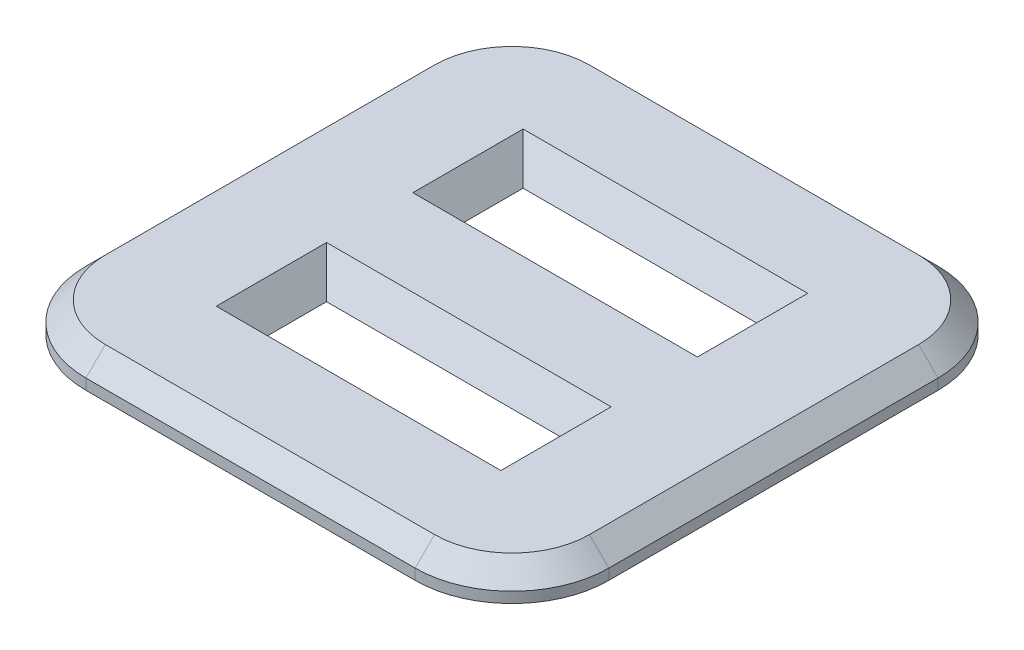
ISO-10303-21;
HEADER;
FILE_DESCRIPTION(('STEP AP214'),'2;1');
FILE_NAME('part.step','',(''),(''),'','','');
FILE_SCHEMA(('AUTOMOTIVE_DESIGN { 1 0 10303 214 1 1 1 1 }'));
ENDSEC;
DATA;
#1=APPLICATION_CONTEXT('core data for automotive mechanical design processes');
#2=APPLICATION_PROTOCOL_DEFINITION('international standard','automotive_design',2000,#1);
#3=PRODUCT_CONTEXT('',#1,'mechanical');
#4=PRODUCT('Part','Part','',(#3));
#5=PRODUCT_RELATED_PRODUCT_CATEGORY('part','',(#4));
#6=PRODUCT_DEFINITION_FORMATION('','',#4);
#7=PRODUCT_DEFINITION_CONTEXT('part definition',#1,'design');
#8=PRODUCT_DEFINITION('design','',#6,#7);
#9=PRODUCT_DEFINITION_SHAPE('','',#8);
#10=(LENGTH_UNIT() NAMED_UNIT(*) SI_UNIT(.MILLI.,.METRE.));
#11=(NAMED_UNIT(*) PLANE_ANGLE_UNIT() SI_UNIT($,.RADIAN.));
#12=(NAMED_UNIT(*) SI_UNIT($,.STERADIAN.) SOLID_ANGLE_UNIT());
#13=UNCERTAINTY_MEASURE_WITH_UNIT(LENGTH_MEASURE(1.E-05),#10,'distance_accuracy_value','');
#14=(GEOMETRIC_REPRESENTATION_CONTEXT(3) GLOBAL_UNCERTAINTY_ASSIGNED_CONTEXT((#13)) GLOBAL_UNIT_ASSIGNED_CONTEXT((#10,
#11,#12)) REPRESENTATION_CONTEXT('',''));
#15=CARTESIAN_POINT('',(0.,0.,0.));
#16=DIRECTION('',(0.,0.,1.));
#17=DIRECTION('',(1.,0.,0.));
#18=AXIS2_PLACEMENT_3D('',#15,#16,#17);
#19=CARTESIAN_POINT('',(-2.7,0.31,-2.7));
#20=DIRECTION('',(1.,0.,0.));
#21=DIRECTION('',(0.,0.,-1.));
#22=AXIS2_PLACEMENT_3D('',#19,#20,#21);
#23=PLANE('',#22);
#24=DIRECTION('',(0.,-1.,0.));
#25=VECTOR('',#24,1.);
#26=CARTESIAN_POINT('',(-2.7,0.31,1.7));
#27=LINE('',#26,#25);
#28=CARTESIAN_POINT('',(-2.7,0.,1.7));
#29=VERTEX_POINT('',#28);
#30=CARTESIAN_POINT('',(-2.7,0.11,1.7));
#31=VERTEX_POINT('',#30);
#32=EDGE_CURVE('E235',#29,#31,#27,.F.);
#33=ORIENTED_EDGE('',*,*,#32,.T.);
#34=DIRECTION('',(0.,0.,-1.));
#35=VECTOR('',#34,1.);
#36=CARTESIAN_POINT('',(-2.7,0.11,-2.7));
#37=LINE('',#36,#35);
#38=CARTESIAN_POINT('',(-2.7,0.11,-1.7));
#39=VERTEX_POINT('',#38);
#40=EDGE_CURVE('E287',#31,#39,#37,.T.);
#41=ORIENTED_EDGE('',*,*,#40,.T.);
#42=DIRECTION('',(0.,-1.,0.));
#43=VECTOR('',#42,1.);
#44=CARTESIAN_POINT('',(-2.7,0.31,-1.7));
#45=LINE('',#44,#43);
#46=CARTESIAN_POINT('',(-2.7,0.,-1.7));
#47=VERTEX_POINT('',#46);
#48=EDGE_CURVE('E238',#39,#47,#45,.T.);
#49=ORIENTED_EDGE('',*,*,#48,.T.);
#50=DIRECTION('',(0.,0.,1.));
#51=VECTOR('',#50,1.);
#52=CARTESIAN_POINT('',(-2.7,0.,-2.7));
#53=LINE('',#52,#51);
#54=EDGE_CURVE('E222',#47,#29,#53,.T.);
#55=ORIENTED_EDGE('',*,*,#54,.T.);
#56=EDGE_LOOP('',(#33,#41,#49,#55));
#57=FACE_BOUND('',#56,.T.);
#58=ADVANCED_FACE('F43',(#57),#23,.F.);
#59=CARTESIAN_POINT('',(2.7,0.31,2.7));
#60=DIRECTION('',(0.,0.,-1.));
#61=DIRECTION('',(-1.,0.,0.));
#62=AXIS2_PLACEMENT_3D('',#59,#60,#61);
#63=PLANE('',#62);
#64=DIRECTION('',(0.,-1.,0.));
#65=VECTOR('',#64,1.);
#66=CARTESIAN_POINT('',(1.7,0.31,2.7));
#67=LINE('',#66,#65);
#68=CARTESIAN_POINT('',(1.7,0.,2.7));
#69=VERTEX_POINT('',#68);
#70=CARTESIAN_POINT('',(1.7,0.11,2.7));
#71=VERTEX_POINT('',#70);
#72=EDGE_CURVE('E260',#69,#71,#67,.F.);
#73=ORIENTED_EDGE('',*,*,#72,.T.);
#74=DIRECTION('',(-1.,0.,0.));
#75=VECTOR('',#74,1.);
#76=CARTESIAN_POINT('',(2.7,0.11,2.7));
#77=LINE('',#76,#75);
#78=CARTESIAN_POINT('',(-1.7,0.11,2.7));
#79=VERTEX_POINT('',#78);
#80=EDGE_CURVE('E283',#71,#79,#77,.T.);
#81=ORIENTED_EDGE('',*,*,#80,.T.);
#82=DIRECTION('',(0.,-1.,0.));
#83=VECTOR('',#82,1.);
#84=CARTESIAN_POINT('',(-1.7,0.31,2.7));
#85=LINE('',#84,#83);
#86=CARTESIAN_POINT('',(-1.7,0.,2.7));
#87=VERTEX_POINT('',#86);
#88=EDGE_CURVE('E258',#79,#87,#85,.T.);
#89=ORIENTED_EDGE('',*,*,#88,.T.);
#90=DIRECTION('',(1.,0.,0.));
#91=VECTOR('',#90,1.);
#92=CARTESIAN_POINT('',(2.7,0.,2.7));
#93=LINE('',#92,#91);
#94=EDGE_CURVE('E225',#87,#69,#93,.T.);
#95=ORIENTED_EDGE('',*,*,#94,.T.);
#96=EDGE_LOOP('',(#73,#81,#89,#95));
#97=FACE_BOUND('',#96,.T.);
#98=ADVANCED_FACE('F356',(#97),#63,.F.);
#99=CARTESIAN_POINT('',(2.7,0.31,-2.7));
#100=DIRECTION('',(-1.,0.,0.));
#101=DIRECTION('',(0.,0.,1.));
#102=AXIS2_PLACEMENT_3D('',#99,#100,#101);
#103=PLANE('',#102);
#104=DIRECTION('',(0.,-1.,0.));
#105=VECTOR('',#104,1.);
#106=CARTESIAN_POINT('',(2.7,0.31,-1.7));
#107=LINE('',#106,#105);
#108=CARTESIAN_POINT('',(2.7,0.,-1.7));
#109=VERTEX_POINT('',#108);
#110=CARTESIAN_POINT('',(2.7,0.11,-1.7));
#111=VERTEX_POINT('',#110);
#112=EDGE_CURVE('E255',#109,#111,#107,.F.);
#113=ORIENTED_EDGE('',*,*,#112,.T.);
#114=DIRECTION('',(0.,0.,1.));
#115=VECTOR('',#114,1.);
#116=CARTESIAN_POINT('',(2.7,0.11,-2.7));
#117=LINE('',#116,#115);
#118=CARTESIAN_POINT('',(2.7,0.11,1.7));
#119=VERTEX_POINT('',#118);
#120=EDGE_CURVE('E295',#111,#119,#117,.T.);
#121=ORIENTED_EDGE('',*,*,#120,.T.);
#122=DIRECTION('',(0.,-1.,0.));
#123=VECTOR('',#122,1.);
#124=CARTESIAN_POINT('',(2.7,0.31,1.7));
#125=LINE('',#124,#123);
#126=CARTESIAN_POINT('',(2.7,0.,1.7));
#127=VERTEX_POINT('',#126);
#128=EDGE_CURVE('E253',#119,#127,#125,.T.);
#129=ORIENTED_EDGE('',*,*,#128,.T.);
#130=DIRECTION('',(0.,0.,-1.));
#131=VECTOR('',#130,1.);
#132=CARTESIAN_POINT('',(2.7,0.,-2.7));
#133=LINE('',#132,#131);
#134=EDGE_CURVE('E229',#127,#109,#133,.T.);
#135=ORIENTED_EDGE('',*,*,#134,.T.);
#136=EDGE_LOOP('',(#113,#121,#129,#135));
#137=FACE_BOUND('',#136,.T.);
#138=ADVANCED_FACE('F362',(#137),#103,.F.);
#139=CARTESIAN_POINT('',(2.7,0.31,-2.7));
#140=DIRECTION('',(0.,0.,1.));
#141=DIRECTION('',(1.,0.,0.));
#142=AXIS2_PLACEMENT_3D('',#139,#140,#141);
#143=PLANE('',#142);
#144=DIRECTION('',(0.,-1.,0.));
#145=VECTOR('',#144,1.);
#146=CARTESIAN_POINT('',(-1.7,0.31,-2.7));
#147=LINE('',#146,#145);
#148=CARTESIAN_POINT('',(-1.7,0.,-2.7));
#149=VERTEX_POINT('',#148);
#150=CARTESIAN_POINT('',(-1.7,0.11,-2.7));
#151=VERTEX_POINT('',#150);
#152=EDGE_CURVE('E250',#149,#151,#147,.F.);
#153=ORIENTED_EDGE('',*,*,#152,.T.);
#154=DIRECTION('',(1.,0.,0.));
#155=VECTOR('',#154,1.);
#156=CARTESIAN_POINT('',(2.7,0.11,-2.7));
#157=LINE('',#156,#155);
#158=CARTESIAN_POINT('',(1.7,0.11,-2.7));
#159=VERTEX_POINT('',#158);
#160=EDGE_CURVE('E291',#151,#159,#157,.T.);
#161=ORIENTED_EDGE('',*,*,#160,.T.);
#162=DIRECTION('',(0.,-1.,0.));
#163=VECTOR('',#162,1.);
#164=CARTESIAN_POINT('',(1.7,0.31,-2.7));
#165=LINE('',#164,#163);
#166=CARTESIAN_POINT('',(1.7,0.,-2.7));
#167=VERTEX_POINT('',#166);
#168=EDGE_CURVE('E248',#159,#167,#165,.T.);
#169=ORIENTED_EDGE('',*,*,#168,.T.);
#170=DIRECTION('',(-1.,0.,0.));
#171=VECTOR('',#170,1.);
#172=CARTESIAN_POINT('',(2.7,0.,-2.7));
#173=LINE('',#172,#171);
#174=EDGE_CURVE('E232',#167,#149,#173,.T.);
#175=ORIENTED_EDGE('',*,*,#174,.T.);
#176=EDGE_LOOP('',(#153,#161,#169,#175));
#177=FACE_BOUND('',#176,.T.);
#178=ADVANCED_FACE('F518',(#177),#143,.F.);
#179=CARTESIAN_POINT('',(0.,0.31,0.));
#180=DIRECTION('',(0.,-1.,0.));
#181=DIRECTION('',(0.,0.,-1.));
#182=AXIS2_PLACEMENT_3D('',#179,#180,#181);
#183=PLANE('',#182);
#184=DIRECTION('',(-1.,0.,0.));
#185=VECTOR('',#184,1.);
#186=CARTESIAN_POINT('',(0.,0.31,1.58449223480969));
#187=LINE('',#186,#185);
#188=CARTESIAN_POINT('',(1.46949223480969,0.31,1.58449223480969));
#189=VERTEX_POINT('',#188);
#190=CARTESIAN_POINT('',(-1.46949223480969,0.31,1.58449223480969));
#191=VERTEX_POINT('',#190);
#192=EDGE_CURVE('E53',#189,#191,#187,.T.);
#193=ORIENTED_EDGE('',*,*,#192,.T.);
#194=DIRECTION('',(0.,0.,-1.));
#195=VECTOR('',#194,1.);
#196=CARTESIAN_POINT('',(-1.46949223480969,0.31,0.));
#197=LINE('',#196,#195);
#198=CARTESIAN_POINT('',(-1.46949223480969,0.31,0.445507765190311));
#199=VERTEX_POINT('',#198);
#200=EDGE_CURVE('E11',#191,#199,#197,.T.);
#201=ORIENTED_EDGE('',*,*,#200,.T.);
#202=DIRECTION('',(1.,0.,0.));
#203=VECTOR('',#202,1.);
#204=CARTESIAN_POINT('',(0.,0.31,0.445507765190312));
#205=LINE('',#204,#203);
#206=CARTESIAN_POINT('',(1.46949223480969,0.31,0.445507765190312));
#207=VERTEX_POINT('',#206);
#208=EDGE_CURVE('E324',#199,#207,#205,.T.);
#209=ORIENTED_EDGE('',*,*,#208,.T.);
#210=DIRECTION('',(0.,0.,1.));
#211=VECTOR('',#210,1.);
#212=CARTESIAN_POINT('',(1.46949223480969,0.31,0.));
#213=LINE('',#212,#211);
#214=EDGE_CURVE('E64',#207,#189,#213,.T.);
#215=ORIENTED_EDGE('',*,*,#214,.T.);
#216=EDGE_LOOP('',(#193,#201,#209,#215));
#217=FACE_BOUND('',#216,.T.);
#218=DIRECTION('',(0.,0.,1.));
#219=VECTOR('',#218,1.);
#220=CARTESIAN_POINT('',(1.46949223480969,0.31,0.));
#221=LINE('',#220,#219);
#222=CARTESIAN_POINT('',(1.46949223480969,0.31,-1.58449223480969));
#223=VERTEX_POINT('',#222);
#224=CARTESIAN_POINT('',(1.46949223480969,0.31,-0.445507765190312));
#225=VERTEX_POINT('',#224);
#226=EDGE_CURVE('E320',#223,#225,#221,.T.);
#227=ORIENTED_EDGE('',*,*,#226,.T.);
#228=DIRECTION('',(-1.,0.,0.));
#229=VECTOR('',#228,1.);
#230=CARTESIAN_POINT('',(0.,0.31,-0.445507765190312));
#231=LINE('',#230,#229);
#232=CARTESIAN_POINT('',(-1.46949223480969,0.31,-0.445507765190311));
#233=VERTEX_POINT('',#232);
#234=EDGE_CURVE('E322',#225,#233,#231,.T.);
#235=ORIENTED_EDGE('',*,*,#234,.T.);
#236=DIRECTION('',(0.,0.,-1.));
#237=VECTOR('',#236,1.);
#238=CARTESIAN_POINT('',(-1.46949223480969,0.31,0.));
#239=LINE('',#238,#237);
#240=CARTESIAN_POINT('',(-1.46949223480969,0.31,-1.58449223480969));
#241=VERTEX_POINT('',#240);
#242=EDGE_CURVE('E197',#233,#241,#239,.T.);
#243=ORIENTED_EDGE('',*,*,#242,.T.);
#244=DIRECTION('',(1.,0.,0.));
#245=VECTOR('',#244,1.);
#246=CARTESIAN_POINT('',(0.,0.31,-1.58449223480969));
#247=LINE('',#246,#245);
#248=EDGE_CURVE('E297',#241,#223,#247,.T.);
#249=ORIENTED_EDGE('',*,*,#248,.T.);
#250=EDGE_LOOP('',(#227,#235,#243,#249));
#251=FACE_BOUND('',#250,.T.);
#252=DIRECTION('',(1.,0.,0.));
#253=VECTOR('',#252,1.);
#254=CARTESIAN_POINT('',(0.,0.31,2.5));
#255=LINE('',#254,#253);
#256=CARTESIAN_POINT('',(-1.7,0.31,2.5));
#257=VERTEX_POINT('',#256);
#258=CARTESIAN_POINT('',(1.7,0.31,2.5));
#259=VERTEX_POINT('',#258);
#260=EDGE_CURVE('E275',#257,#259,#255,.T.);
#261=ORIENTED_EDGE('',*,*,#260,.T.);
#262=CARTESIAN_POINT('',(1.7,0.31,1.7));
#263=DIRECTION('',(0.,-1.,0.));
#264=DIRECTION('',(0.,0.,-1.));
#265=AXIS2_PLACEMENT_3D('',#262,#263,#264);
#266=CIRCLE('',#265,0.800000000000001);
#267=CARTESIAN_POINT('',(2.5,0.31,1.7));
#268=VERTEX_POINT('',#267);
#269=EDGE_CURVE('E277',#259,#268,#266,.F.);
#270=ORIENTED_EDGE('',*,*,#269,.T.);
#271=DIRECTION('',(0.,0.,-1.));
#272=VECTOR('',#271,1.);
#273=CARTESIAN_POINT('',(2.5,0.31,0.));
#274=LINE('',#273,#272);
#275=CARTESIAN_POINT('',(2.5,0.31,-1.7));
#276=VERTEX_POINT('',#275);
#277=EDGE_CURVE('E263',#268,#276,#274,.T.);
#278=ORIENTED_EDGE('',*,*,#277,.T.);
#279=CARTESIAN_POINT('',(1.7,0.31,-1.7));
#280=DIRECTION('',(0.,-1.,0.));
#281=DIRECTION('',(0.,0.,-1.));
#282=AXIS2_PLACEMENT_3D('',#279,#280,#281);
#283=CIRCLE('',#282,0.800000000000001);
#284=CARTESIAN_POINT('',(1.7,0.31,-2.5));
#285=VERTEX_POINT('',#284);
#286=EDGE_CURVE('E265',#276,#285,#283,.F.);
#287=ORIENTED_EDGE('',*,*,#286,.T.);
#288=DIRECTION('',(-1.,0.,0.));
#289=VECTOR('',#288,1.);
#290=CARTESIAN_POINT('',(0.,0.31,-2.5));
#291=LINE('',#290,#289);
#292=CARTESIAN_POINT('',(-1.7,0.31,-2.5));
#293=VERTEX_POINT('',#292);
#294=EDGE_CURVE('E267',#285,#293,#291,.T.);
#295=ORIENTED_EDGE('',*,*,#294,.T.);
#296=CARTESIAN_POINT('',(-1.7,0.31,-1.7));
#297=DIRECTION('',(0.,-1.,0.));
#298=DIRECTION('',(0.,0.,-1.));
#299=AXIS2_PLACEMENT_3D('',#296,#297,#298);
#300=CIRCLE('',#299,0.800000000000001);
#301=CARTESIAN_POINT('',(-2.5,0.31,-1.7));
#302=VERTEX_POINT('',#301);
#303=EDGE_CURVE('E269',#293,#302,#300,.F.);
#304=ORIENTED_EDGE('',*,*,#303,.T.);
#305=DIRECTION('',(0.,0.,1.));
#306=VECTOR('',#305,1.);
#307=CARTESIAN_POINT('',(-2.5,0.31,0.));
#308=LINE('',#307,#306);
#309=CARTESIAN_POINT('',(-2.5,0.31,1.7));
#310=VERTEX_POINT('',#309);
#311=EDGE_CURVE('E271',#302,#310,#308,.T.);
#312=ORIENTED_EDGE('',*,*,#311,.T.);
#313=CARTESIAN_POINT('',(-1.7,0.31,1.7));
#314=DIRECTION('',(0.,-1.,0.));
#315=DIRECTION('',(0.,0.,-1.));
#316=AXIS2_PLACEMENT_3D('',#313,#314,#315);
#317=CIRCLE('',#316,0.800000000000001);
#318=EDGE_CURVE('E273',#310,#257,#317,.F.);
#319=ORIENTED_EDGE('',*,*,#318,.T.);
#320=EDGE_LOOP('',(#261,#270,#278,#287,#295,#304,#312,#319));
#321=FACE_BOUND('',#320,.T.);
#322=ADVANCED_FACE('F344',(#217,#251,#321),#183,.F.);
#323=CARTESIAN_POINT('',(0.,0.,0.));
#324=DIRECTION('',(0.,-1.,0.));
#325=DIRECTION('',(0.,0.,-1.));
#326=AXIS2_PLACEMENT_3D('',#323,#324,#325);
#327=PLANE('',#326);
#328=DIRECTION('',(0.,0.,1.));
#329=VECTOR('',#328,1.);
#330=CARTESIAN_POINT('',(-1.25,0.,-1.365));
#331=LINE('',#330,#329);
#332=CARTESIAN_POINT('',(-1.25,0.,-1.365));
#333=VERTEX_POINT('',#332);
#334=CARTESIAN_POINT('',(-1.25,0.,-0.664999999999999));
#335=VERTEX_POINT('',#334);
#336=EDGE_CURVE('E181',#333,#335,#331,.T.);
#337=ORIENTED_EDGE('',*,*,#336,.T.);
#338=DIRECTION('',(1.,0.,0.));
#339=VECTOR('',#338,1.);
#340=CARTESIAN_POINT('',(1.25,0.,-0.664999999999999));
#341=LINE('',#340,#339);
#342=CARTESIAN_POINT('',(1.25,0.,-0.664999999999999));
#343=VERTEX_POINT('',#342);
#344=EDGE_CURVE('E186',#335,#343,#341,.T.);
#345=ORIENTED_EDGE('',*,*,#344,.T.);
#346=DIRECTION('',(0.,0.,-1.));
#347=VECTOR('',#346,1.);
#348=CARTESIAN_POINT('',(1.25,0.,-1.365));
#349=LINE('',#348,#347);
#350=CARTESIAN_POINT('',(1.25,0.,-1.365));
#351=VERTEX_POINT('',#350);
#352=EDGE_CURVE('E207',#343,#351,#349,.T.);
#353=ORIENTED_EDGE('',*,*,#352,.T.);
#354=DIRECTION('',(-1.,0.,0.));
#355=VECTOR('',#354,1.);
#356=CARTESIAN_POINT('',(1.25,0.,-1.365));
#357=LINE('',#356,#355);
#358=EDGE_CURVE('E188',#351,#333,#357,.T.);
#359=ORIENTED_EDGE('',*,*,#358,.T.);
#360=EDGE_LOOP('',(#337,#345,#353,#359));
#361=FACE_BOUND('',#360,.T.);
#362=DIRECTION('',(0.,0.,-1.));
#363=VECTOR('',#362,1.);
#364=CARTESIAN_POINT('',(1.25,0.,1.365));
#365=LINE('',#364,#363);
#366=CARTESIAN_POINT('',(1.25,0.,1.365));
#367=VERTEX_POINT('',#366);
#368=CARTESIAN_POINT('',(1.25,0.,0.664999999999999));
#369=VERTEX_POINT('',#368);
#370=EDGE_CURVE('E192',#367,#369,#365,.T.);
#371=ORIENTED_EDGE('',*,*,#370,.T.);
#372=DIRECTION('',(-1.,0.,0.));
#373=VECTOR('',#372,1.);
#374=CARTESIAN_POINT('',(1.25,0.,0.664999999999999));
#375=LINE('',#374,#373);
#376=CARTESIAN_POINT('',(-1.25,0.,0.664999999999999));
#377=VERTEX_POINT('',#376);
#378=EDGE_CURVE('E219',#369,#377,#375,.T.);
#379=ORIENTED_EDGE('',*,*,#378,.T.);
#380=DIRECTION('',(0.,0.,1.));
#381=VECTOR('',#380,1.);
#382=CARTESIAN_POINT('',(-1.25,0.,1.365));
#383=LINE('',#382,#381);
#384=CARTESIAN_POINT('',(-1.25,0.,1.365));
#385=VERTEX_POINT('',#384);
#386=EDGE_CURVE('E215',#377,#385,#383,.T.);
#387=ORIENTED_EDGE('',*,*,#386,.T.);
#388=DIRECTION('',(1.,0.,0.));
#389=VECTOR('',#388,1.);
#390=CARTESIAN_POINT('',(1.25,0.,1.365));
#391=LINE('',#390,#389);
#392=EDGE_CURVE('E213',#385,#367,#391,.T.);
#393=ORIENTED_EDGE('',*,*,#392,.T.);
#394=EDGE_LOOP('',(#371,#379,#387,#393));
#395=FACE_BOUND('',#394,.T.);
#396=ORIENTED_EDGE('',*,*,#54,.F.);
#397=CARTESIAN_POINT('',(-1.7,0.,-1.7));
#398=DIRECTION('',(0.,-1.,0.));
#399=DIRECTION('',(0.,0.,-1.));
#400=AXIS2_PLACEMENT_3D('',#397,#398,#399);
#401=CIRCLE('',#400,1.);
#402=EDGE_CURVE('E246',#47,#149,#401,.T.);
#403=ORIENTED_EDGE('',*,*,#402,.T.);
#404=ORIENTED_EDGE('',*,*,#174,.F.);
#405=CARTESIAN_POINT('',(1.7,0.,-1.7));
#406=DIRECTION('',(0.,-1.,0.));
#407=DIRECTION('',(0.,0.,-1.));
#408=AXIS2_PLACEMENT_3D('',#405,#406,#407);
#409=CIRCLE('',#408,1.);
#410=EDGE_CURVE('E244',#167,#109,#409,.T.);
#411=ORIENTED_EDGE('',*,*,#410,.T.);
#412=ORIENTED_EDGE('',*,*,#134,.F.);
#413=CARTESIAN_POINT('',(1.7,0.,1.7));
#414=DIRECTION('',(0.,-1.,0.));
#415=DIRECTION('',(0.,0.,-1.));
#416=AXIS2_PLACEMENT_3D('',#413,#414,#415);
#417=CIRCLE('',#416,1.);
#418=EDGE_CURVE('E242',#127,#69,#417,.T.);
#419=ORIENTED_EDGE('',*,*,#418,.T.);
#420=ORIENTED_EDGE('',*,*,#94,.F.);
#421=CARTESIAN_POINT('',(-1.7,0.,1.7));
#422=DIRECTION('',(0.,-1.,0.));
#423=DIRECTION('',(0.,0.,-1.));
#424=AXIS2_PLACEMENT_3D('',#421,#422,#423);
#425=CIRCLE('',#424,1.);
#426=EDGE_CURVE('E240',#87,#29,#425,.T.);
#427=ORIENTED_EDGE('',*,*,#426,.T.);
#428=EDGE_LOOP('',(#396,#403,#404,#411,#412,#419,#420,#427));
#429=FACE_BOUND('',#428,.T.);
#430=ADVANCED_FACE('F183',(#361,#395,#429),#327,.T.);
#431=CARTESIAN_POINT('',(-1.7,0.31,-1.7));
#432=DIRECTION('',(0.,-1.,0.));
#433=DIRECTION('',(0.,0.,-1.));
#434=AXIS2_PLACEMENT_3D('',#431,#432,#433);
#435=CYLINDRICAL_SURFACE('',#434,1.);
#436=ORIENTED_EDGE('',*,*,#48,.F.);
#437=CARTESIAN_POINT('',(-1.7,0.11,-1.7));
#438=DIRECTION('',(0.,-1.,0.));
#439=DIRECTION('',(0.,0.,-1.));
#440=AXIS2_PLACEMENT_3D('',#437,#438,#439);
#441=CIRCLE('',#440,1.);
#442=EDGE_CURVE('E289',#39,#151,#441,.T.);
#443=ORIENTED_EDGE('',*,*,#442,.T.);
#444=ORIENTED_EDGE('',*,*,#152,.F.);
#445=ORIENTED_EDGE('',*,*,#402,.F.);
#446=EDGE_LOOP('',(#436,#443,#444,#445));
#447=FACE_BOUND('',#446,.T.);
#448=ADVANCED_FACE('F367',(#447),#435,.T.);
#449=CARTESIAN_POINT('',(1.7,0.31,-1.7));
#450=DIRECTION('',(0.,-1.,0.));
#451=DIRECTION('',(0.,0.,-1.));
#452=AXIS2_PLACEMENT_3D('',#449,#450,#451);
#453=CYLINDRICAL_SURFACE('',#452,1.);
#454=ORIENTED_EDGE('',*,*,#168,.F.);
#455=CARTESIAN_POINT('',(1.7,0.11,-1.7));
#456=DIRECTION('',(0.,-1.,0.));
#457=DIRECTION('',(0.,0.,-1.));
#458=AXIS2_PLACEMENT_3D('',#455,#456,#457);
#459=CIRCLE('',#458,1.);
#460=EDGE_CURVE('E293',#159,#111,#459,.T.);
#461=ORIENTED_EDGE('',*,*,#460,.T.);
#462=ORIENTED_EDGE('',*,*,#112,.F.);
#463=ORIENTED_EDGE('',*,*,#410,.F.);
#464=EDGE_LOOP('',(#454,#461,#462,#463));
#465=FACE_BOUND('',#464,.T.);
#466=ADVANCED_FACE('F370',(#465),#453,.T.);
#467=CARTESIAN_POINT('',(1.7,0.31,1.7));
#468=DIRECTION('',(0.,-1.,0.));
#469=DIRECTION('',(0.,0.,-1.));
#470=AXIS2_PLACEMENT_3D('',#467,#468,#469);
#471=CYLINDRICAL_SURFACE('',#470,1.);
#472=ORIENTED_EDGE('',*,*,#128,.F.);
#473=CARTESIAN_POINT('',(1.7,0.11,1.7));
#474=DIRECTION('',(0.,-1.,0.));
#475=DIRECTION('',(0.,0.,-1.));
#476=AXIS2_PLACEMENT_3D('',#473,#474,#475);
#477=CIRCLE('',#476,1.);
#478=EDGE_CURVE('E280',#119,#71,#477,.T.);
#479=ORIENTED_EDGE('',*,*,#478,.T.);
#480=ORIENTED_EDGE('',*,*,#72,.F.);
#481=ORIENTED_EDGE('',*,*,#418,.F.);
#482=EDGE_LOOP('',(#472,#479,#480,#481));
#483=FACE_BOUND('',#482,.T.);
#484=ADVANCED_FACE('F374',(#483),#471,.T.);
#485=CARTESIAN_POINT('',(-1.7,0.31,1.7));
#486=DIRECTION('',(0.,-1.,0.));
#487=DIRECTION('',(0.,0.,-1.));
#488=AXIS2_PLACEMENT_3D('',#485,#486,#487);
#489=CYLINDRICAL_SURFACE('',#488,1.);
#490=ORIENTED_EDGE('',*,*,#88,.F.);
#491=CARTESIAN_POINT('',(-1.7,0.11,1.7));
#492=DIRECTION('',(0.,-1.,0.));
#493=DIRECTION('',(0.,0.,-1.));
#494=AXIS2_PLACEMENT_3D('',#491,#492,#493);
#495=CIRCLE('',#494,1.);
#496=EDGE_CURVE('E285',#79,#31,#495,.T.);
#497=ORIENTED_EDGE('',*,*,#496,.T.);
#498=ORIENTED_EDGE('',*,*,#32,.F.);
#499=ORIENTED_EDGE('',*,*,#426,.F.);
#500=EDGE_LOOP('',(#490,#497,#498,#499));
#501=FACE_BOUND('',#500,.T.);
#502=ADVANCED_FACE('F378',(#501),#489,.T.);
#503=CARTESIAN_POINT('',(-1.7,0.31,-1.7));
#504=DIRECTION('',(0.,-1.,0.));
#505=DIRECTION('',(0.,0.,-1.));
#506=AXIS2_PLACEMENT_3D('',#503,#504,#505);
#507=CONICAL_SURFACE('',#506,0.800000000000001,0.785398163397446);
#508=DIRECTION('',(0.,0.707106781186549,0.707106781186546));
#509=VECTOR('',#508,1.);
#510=CARTESIAN_POINT('',(-1.7,0.11,-2.7));
#511=LINE('',#510,#509);
#512=EDGE_CURVE('E313',#151,#293,#511,.T.);
#513=ORIENTED_EDGE('',*,*,#512,.F.);
#514=ORIENTED_EDGE('',*,*,#442,.F.);
#515=DIRECTION('',(-0.707106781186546,-0.707106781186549,0.));
#516=VECTOR('',#515,1.);
#517=CARTESIAN_POINT('',(-2.5,0.31,-1.7));
#518=LINE('',#517,#516);
#519=EDGE_CURVE('E226',#302,#39,#518,.T.);
#520=ORIENTED_EDGE('',*,*,#519,.F.);
#521=ORIENTED_EDGE('',*,*,#303,.F.);
#522=EDGE_LOOP('',(#513,#514,#520,#521));
#523=FACE_BOUND('',#522,.T.);
#524=ADVANCED_FACE('F382',(#523),#507,.T.);
#525=CARTESIAN_POINT('',(-2.5,0.31,0.));
#526=DIRECTION('',(0.707106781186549,-0.707106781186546,0.));
#527=DIRECTION('',(0.,0.,1.));
#528=AXIS2_PLACEMENT_3D('',#525,#526,#527);
#529=PLANE('',#528);
#530=ORIENTED_EDGE('',*,*,#519,.T.);
#531=ORIENTED_EDGE('',*,*,#40,.F.);
#532=DIRECTION('',(-0.707106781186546,-0.707106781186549,0.));
#533=VECTOR('',#532,1.);
#534=CARTESIAN_POINT('',(-2.5,0.31,1.7));
#535=LINE('',#534,#533);
#536=EDGE_CURVE('E310',#310,#31,#535,.T.);
#537=ORIENTED_EDGE('',*,*,#536,.F.);
#538=ORIENTED_EDGE('',*,*,#311,.F.);
#539=EDGE_LOOP('',(#530,#531,#537,#538));
#540=FACE_BOUND('',#539,.T.);
#541=ADVANCED_FACE('F428',(#540),#529,.F.);
#542=CARTESIAN_POINT('',(0.,0.31,-2.5));
#543=DIRECTION('',(0.,-0.707106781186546,0.707106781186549));
#544=DIRECTION('',(-1.,0.,0.));
#545=AXIS2_PLACEMENT_3D('',#542,#543,#544);
#546=PLANE('',#545);
#547=ORIENTED_EDGE('',*,*,#512,.T.);
#548=ORIENTED_EDGE('',*,*,#294,.F.);
#549=DIRECTION('',(0.,0.707106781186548,0.707106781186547));
#550=VECTOR('',#549,1.);
#551=CARTESIAN_POINT('',(1.7,0.11,-2.7));
#552=LINE('',#551,#550);
#553=EDGE_CURVE('E307',#159,#285,#552,.T.);
#554=ORIENTED_EDGE('',*,*,#553,.F.);
#555=ORIENTED_EDGE('',*,*,#160,.F.);
#556=EDGE_LOOP('',(#547,#548,#554,#555));
#557=FACE_BOUND('',#556,.T.);
#558=ADVANCED_FACE('F421',(#557),#546,.F.);
#559=CARTESIAN_POINT('',(-1.7,0.31,1.7));
#560=DIRECTION('',(0.,-1.,0.));
#561=DIRECTION('',(0.,0.,-1.));
#562=AXIS2_PLACEMENT_3D('',#559,#560,#561);
#563=CONICAL_SURFACE('',#562,0.800000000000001,0.785398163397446);
#564=ORIENTED_EDGE('',*,*,#536,.T.);
#565=ORIENTED_EDGE('',*,*,#496,.F.);
#566=DIRECTION('',(0.,-0.707106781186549,0.707106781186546));
#567=VECTOR('',#566,1.);
#568=CARTESIAN_POINT('',(-1.7,0.31,2.5));
#569=LINE('',#568,#567);
#570=EDGE_CURVE('E304',#257,#79,#569,.T.);
#571=ORIENTED_EDGE('',*,*,#570,.F.);
#572=ORIENTED_EDGE('',*,*,#318,.F.);
#573=EDGE_LOOP('',(#564,#565,#571,#572));
#574=FACE_BOUND('',#573,.T.);
#575=ADVANCED_FACE('F414',(#574),#563,.T.);
#576=CARTESIAN_POINT('',(1.7,0.31,-1.7));
#577=DIRECTION('',(0.,-1.,0.));
#578=DIRECTION('',(0.,0.,-1.));
#579=AXIS2_PLACEMENT_3D('',#576,#577,#578);
#580=CONICAL_SURFACE('',#579,0.800000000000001,0.785398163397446);
#581=ORIENTED_EDGE('',*,*,#553,.T.);
#582=ORIENTED_EDGE('',*,*,#286,.F.);
#583=DIRECTION('',(-0.707106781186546,0.707106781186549,0.));
#584=VECTOR('',#583,1.);
#585=CARTESIAN_POINT('',(2.7,0.11,-1.7));
#586=LINE('',#585,#584);
#587=EDGE_CURVE('E301',#111,#276,#586,.T.);
#588=ORIENTED_EDGE('',*,*,#587,.F.);
#589=ORIENTED_EDGE('',*,*,#460,.F.);
#590=EDGE_LOOP('',(#581,#582,#588,#589));
#591=FACE_BOUND('',#590,.T.);
#592=ADVANCED_FACE('F407',(#591),#580,.T.);
#593=CARTESIAN_POINT('',(0.,0.31,2.5));
#594=DIRECTION('',(0.,-0.707106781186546,-0.707106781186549));
#595=DIRECTION('',(1.,0.,0.));
#596=AXIS2_PLACEMENT_3D('',#593,#594,#595);
#597=PLANE('',#596);
#598=ORIENTED_EDGE('',*,*,#570,.T.);
#599=ORIENTED_EDGE('',*,*,#80,.F.);
#600=DIRECTION('',(0.,-0.707106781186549,0.707106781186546));
#601=VECTOR('',#600,1.);
#602=CARTESIAN_POINT('',(1.7,0.31,2.5));
#603=LINE('',#602,#601);
#604=EDGE_CURVE('E299',#259,#71,#603,.T.);
#605=ORIENTED_EDGE('',*,*,#604,.F.);
#606=ORIENTED_EDGE('',*,*,#260,.F.);
#607=EDGE_LOOP('',(#598,#599,#605,#606));
#608=FACE_BOUND('',#607,.T.);
#609=ADVANCED_FACE('F400',(#608),#597,.F.);
#610=CARTESIAN_POINT('',(2.5,0.31,0.));
#611=DIRECTION('',(-0.707106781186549,-0.707106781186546,0.));
#612=DIRECTION('',(0.,0.,-1.));
#613=AXIS2_PLACEMENT_3D('',#610,#611,#612);
#614=PLANE('',#613);
#615=ORIENTED_EDGE('',*,*,#587,.T.);
#616=ORIENTED_EDGE('',*,*,#277,.F.);
#617=DIRECTION('',(-0.707106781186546,0.707106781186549,0.));
#618=VECTOR('',#617,1.);
#619=CARTESIAN_POINT('',(2.7,0.11,1.7));
#620=LINE('',#619,#618);
#621=EDGE_CURVE('E212',#119,#268,#620,.T.);
#622=ORIENTED_EDGE('',*,*,#621,.F.);
#623=ORIENTED_EDGE('',*,*,#120,.F.);
#624=EDGE_LOOP('',(#615,#616,#622,#623));
#625=FACE_BOUND('',#624,.T.);
#626=ADVANCED_FACE('F393',(#625),#614,.F.);
#627=CARTESIAN_POINT('',(1.7,0.31,1.7));
#628=DIRECTION('',(0.,-1.,0.));
#629=DIRECTION('',(0.,0.,-1.));
#630=AXIS2_PLACEMENT_3D('',#627,#628,#629);
#631=CONICAL_SURFACE('',#630,0.800000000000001,0.785398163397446);
#632=ORIENTED_EDGE('',*,*,#604,.T.);
#633=ORIENTED_EDGE('',*,*,#478,.F.);
#634=ORIENTED_EDGE('',*,*,#621,.T.);
#635=ORIENTED_EDGE('',*,*,#269,.F.);
#636=EDGE_LOOP('',(#632,#633,#634,#635));
#637=FACE_BOUND('',#636,.T.);
#638=ADVANCED_FACE('F385',(#637),#631,.T.);
#639=CARTESIAN_POINT('',(1.25,0.,1.365));
#640=DIRECTION('',(0.81613759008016,-0.577857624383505,0.));
#641=DIRECTION('',(0.,0.,-1.));
#642=AXIS2_PLACEMENT_3D('',#639,#640,#641);
#643=PLANE('',#642);
#644=DIRECTION('',(0.500329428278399,0.7066405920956,0.500329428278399));
#645=VECTOR('',#644,1.);
#646=CARTESIAN_POINT('',(1.25,0.,1.365));
#647=LINE('',#646,#645);
#648=EDGE_CURVE('E332',#189,#367,#647,.F.);
#649=ORIENTED_EDGE('',*,*,#648,.F.);
#650=ORIENTED_EDGE('',*,*,#214,.F.);
#651=DIRECTION('',(0.500329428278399,0.7066405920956,-0.500329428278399));
#652=VECTOR('',#651,1.);
#653=CARTESIAN_POINT('',(1.07476932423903,-0.247487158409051,0.840230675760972));
#654=LINE('',#653,#652);
#655=EDGE_CURVE('E216',#369,#207,#654,.T.);
#656=ORIENTED_EDGE('',*,*,#655,.F.);
#657=ORIENTED_EDGE('',*,*,#370,.F.);
#658=EDGE_LOOP('',(#649,#650,#656,#657));
#659=FACE_BOUND('',#658,.T.);
#660=ADVANCED_FACE('F392',(#659),#643,.F.);
#661=CARTESIAN_POINT('',(1.25,0.,0.664999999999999));
#662=DIRECTION('',(0.,-0.577857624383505,-0.81613759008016));
#663=DIRECTION('',(-1.,0.,0.));
#664=AXIS2_PLACEMENT_3D('',#661,#662,#663);
#665=PLANE('',#664);
#666=ORIENTED_EDGE('',*,*,#655,.T.);
#667=ORIENTED_EDGE('',*,*,#208,.F.);
#668=DIRECTION('',(0.500329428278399,-0.7066405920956,0.500329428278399));
#669=VECTOR('',#668,1.);
#670=CARTESIAN_POINT('',(-1.07476932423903,-0.247487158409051,0.840230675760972));
#671=LINE('',#670,#669);
#672=EDGE_CURVE('E330',#377,#199,#671,.F.);
#673=ORIENTED_EDGE('',*,*,#672,.F.);
#674=ORIENTED_EDGE('',*,*,#378,.F.);
#675=EDGE_LOOP('',(#666,#667,#673,#674));
#676=FACE_BOUND('',#675,.T.);
#677=ADVANCED_FACE('F455',(#676),#665,.F.);
#678=CARTESIAN_POINT('',(1.25,0.,1.365));
#679=DIRECTION('',(0.,-0.577857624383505,0.81613759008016));
#680=DIRECTION('',(1.,0.,0.));
#681=AXIS2_PLACEMENT_3D('',#678,#679,#680);
#682=PLANE('',#681);
#683=ORIENTED_EDGE('',*,*,#648,.T.);
#684=ORIENTED_EDGE('',*,*,#392,.F.);
#685=DIRECTION('',(-0.500329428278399,0.7066405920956,0.500329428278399));
#686=VECTOR('',#685,1.);
#687=CARTESIAN_POINT('',(-1.25,0.,1.365));
#688=LINE('',#687,#686);
#689=EDGE_CURVE('E328',#191,#385,#688,.F.);
#690=ORIENTED_EDGE('',*,*,#689,.F.);
#691=ORIENTED_EDGE('',*,*,#192,.F.);
#692=EDGE_LOOP('',(#683,#684,#690,#691));
#693=FACE_BOUND('',#692,.T.);
#694=ADVANCED_FACE('F448',(#693),#682,.F.);
#695=CARTESIAN_POINT('',(-1.25,0.,1.365));
#696=DIRECTION('',(-0.81613759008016,-0.577857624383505,0.));
#697=DIRECTION('',(0.,0.,1.));
#698=AXIS2_PLACEMENT_3D('',#695,#696,#697);
#699=PLANE('',#698);
#700=ORIENTED_EDGE('',*,*,#672,.T.);
#701=ORIENTED_EDGE('',*,*,#200,.F.);
#702=ORIENTED_EDGE('',*,*,#689,.T.);
#703=ORIENTED_EDGE('',*,*,#386,.F.);
#704=EDGE_LOOP('',(#700,#701,#702,#703));
#705=FACE_BOUND('',#704,.T.);
#706=ADVANCED_FACE('F442',(#705),#699,.F.);
#707=CARTESIAN_POINT('',(1.25,0.,-1.365));
#708=DIRECTION('',(0.,-0.577857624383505,-0.81613759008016));
#709=DIRECTION('',(-1.,0.,0.));
#710=AXIS2_PLACEMENT_3D('',#707,#708,#709);
#711=PLANE('',#710);
#712=DIRECTION('',(0.500329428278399,0.7066405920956,-0.500329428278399));
#713=VECTOR('',#712,1.);
#714=CARTESIAN_POINT('',(1.25,0.,-1.365));
#715=LINE('',#714,#713);
#716=EDGE_CURVE('E201',#223,#351,#715,.F.);
#717=ORIENTED_EDGE('',*,*,#716,.F.);
#718=ORIENTED_EDGE('',*,*,#248,.F.);
#719=DIRECTION('',(0.500329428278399,-0.7066405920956,0.500329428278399));
#720=VECTOR('',#719,1.);
#721=CARTESIAN_POINT('',(-1.25,0.,-1.365));
#722=LINE('',#721,#720);
#723=EDGE_CURVE('E48',#333,#241,#722,.F.);
#724=ORIENTED_EDGE('',*,*,#723,.F.);
#725=ORIENTED_EDGE('',*,*,#358,.F.);
#726=EDGE_LOOP('',(#717,#718,#724,#725));
#727=FACE_BOUND('',#726,.T.);
#728=ADVANCED_FACE('F46',(#727),#711,.F.);
#729=CARTESIAN_POINT('',(-1.25,0.,-1.365));
#730=DIRECTION('',(-0.81613759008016,-0.577857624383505,0.));
#731=DIRECTION('',(0.,0.,1.));
#732=AXIS2_PLACEMENT_3D('',#729,#730,#731);
#733=PLANE('',#732);
#734=ORIENTED_EDGE('',*,*,#723,.T.);
#735=ORIENTED_EDGE('',*,*,#242,.F.);
#736=DIRECTION('',(0.500329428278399,-0.7066405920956,-0.500329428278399));
#737=VECTOR('',#736,1.);
#738=CARTESIAN_POINT('',(-0.624176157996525,-0.883882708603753,-1.29082384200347));
#739=LINE('',#738,#737);
#740=EDGE_CURVE('E195',#335,#233,#739,.F.);
#741=ORIENTED_EDGE('',*,*,#740,.F.);
#742=ORIENTED_EDGE('',*,*,#336,.F.);
#743=EDGE_LOOP('',(#734,#735,#741,#742));
#744=FACE_BOUND('',#743,.T.);
#745=ADVANCED_FACE('F196',(#744),#733,.F.);
#746=CARTESIAN_POINT('',(1.25,0.,-1.365));
#747=DIRECTION('',(0.81613759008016,-0.577857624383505,0.));
#748=DIRECTION('',(0.,0.,-1.));
#749=AXIS2_PLACEMENT_3D('',#746,#747,#748);
#750=PLANE('',#749);
#751=ORIENTED_EDGE('',*,*,#716,.T.);
#752=ORIENTED_EDGE('',*,*,#352,.F.);
#753=DIRECTION('',(0.500329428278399,0.7066405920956,0.500329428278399));
#754=VECTOR('',#753,1.);
#755=CARTESIAN_POINT('',(1.25,0.,-0.664999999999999));
#756=LINE('',#755,#754);
#757=EDGE_CURVE('E202',#225,#343,#756,.F.);
#758=ORIENTED_EDGE('',*,*,#757,.F.);
#759=ORIENTED_EDGE('',*,*,#226,.F.);
#760=EDGE_LOOP('',(#751,#752,#758,#759));
#761=FACE_BOUND('',#760,.T.);
#762=ADVANCED_FACE('F346',(#761),#750,.F.);
#763=CARTESIAN_POINT('',(1.25,0.,-0.664999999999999));
#764=DIRECTION('',(0.,-0.577857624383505,0.81613759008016));
#765=DIRECTION('',(1.,0.,0.));
#766=AXIS2_PLACEMENT_3D('',#763,#764,#765);
#767=PLANE('',#766);
#768=ORIENTED_EDGE('',*,*,#740,.T.);
#769=ORIENTED_EDGE('',*,*,#234,.F.);
#770=ORIENTED_EDGE('',*,*,#757,.T.);
#771=ORIENTED_EDGE('',*,*,#344,.F.);
#772=EDGE_LOOP('',(#768,#769,#770,#771));
#773=FACE_BOUND('',#772,.T.);
#774=ADVANCED_FACE('F204',(#773),#767,.F.);
#775=CLOSED_SHELL('',(#58,#98,#138,#178,#322,#430,#448,#466,#484,#502,#524,#541,#558,#575,#592,
#609,#626,#638,#660,#677,#694,#706,#728,#745,#762,#774));
#776=MANIFOLD_SOLID_BREP('B2',#775);
#777=ADVANCED_BREP_SHAPE_REPRESENTATION('',(#18,#776),#14);
#778=SHAPE_DEFINITION_REPRESENTATION(#9,#777);
ENDSEC;
END-ISO-10303-21;
